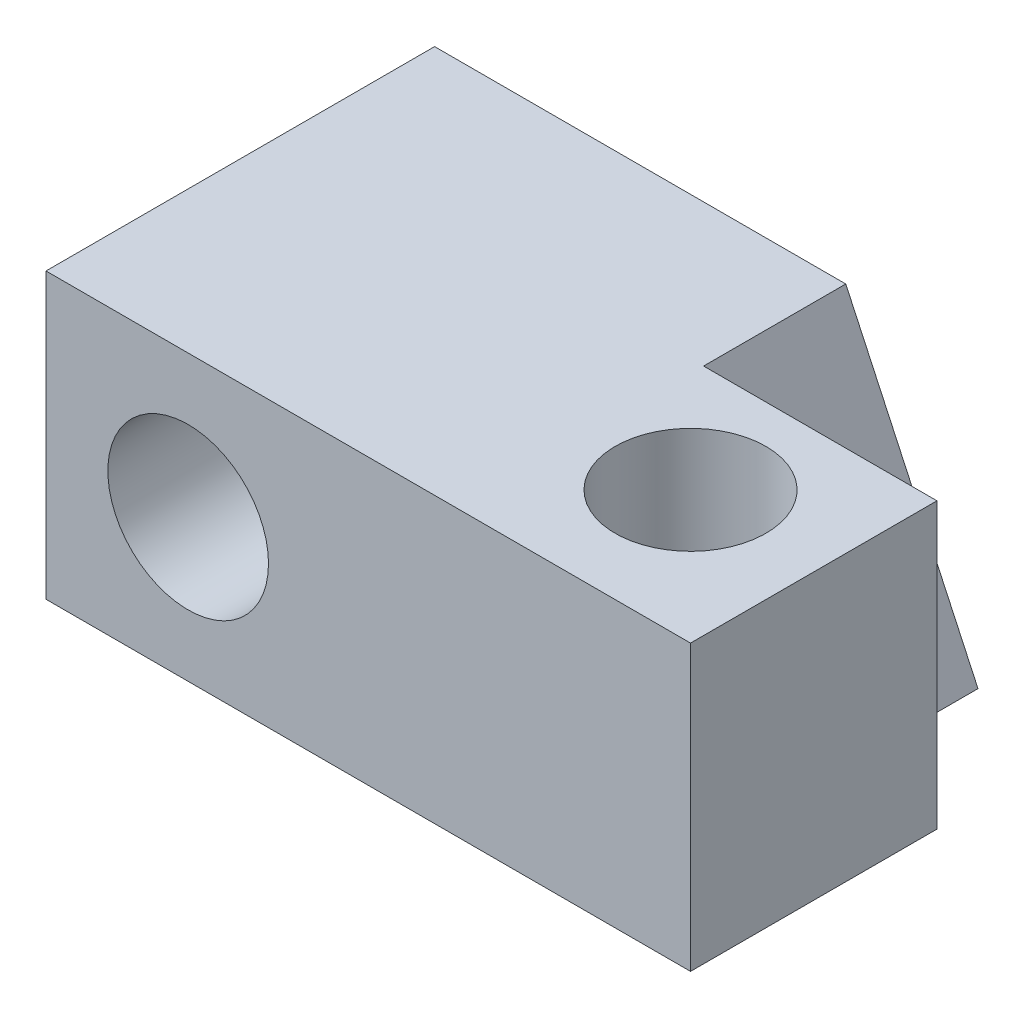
from build123d import *

# Parameters (mm, degrees)
SKETCH1_W                           = 17.272
SKETCH1_H                           = 7.62
EXTRUDE1_DEPTH                      = 10.414
F_10_32_TAPPED_HOLE1_D              = 4.0386
F_18_0_169500_DIAMETER_HOLE1_D      = 4.3053
F_1_8_0_125000_DIAMETER_HOLE1_D     = 3.175
F_1_8_0_125000_DIAMETER_HOLE1_DEPTH = 5.08
F_1_8_0_125000_DIAMETER_HOLE1_TIP   = 0.953866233
CUT_EXTRUDE1_DEPTH                  = 3.81


with BuildPart() as part:
    # Sketch1 → Extrude1 (new body)
    with BuildSketch(Plane.XY):
        with Locations((8.636, 3.81)):
            Rectangle(SKETCH1_W, SKETCH1_H)
    extrude(amount=EXTRUDE1_DEPTH)

    # 10-32 Tapped Hole1 (through all)
    with Locations(Plane.XZ):
        with Locations((13.716, 6.858)):
            Hole(F_10_32_TAPPED_HOLE1_D / 2)

    # 18 _0.169500_ Diameter Hole1 (through all)
    with Locations(Plane.XY.offset(10.414)):
        with Locations((3.81, 3.81)):
            Hole(F_18_0_169500_DIAMETER_HOLE1_D / 2)

    # 1_8 _0.125000_ Diameter Hole1
    with Locations(Plane(origin=(0, 0, 0), x_dir=(-1, 0, 0), z_dir=(0, 0, -1))):
        with Locations((-9.779, 2.54)):
            Hole(F_1_8_0_125000_DIAMETER_HOLE1_D / 2, depth=F_1_8_0_125000_DIAMETER_HOLE1_DEPTH)
            with Locations((0, 0, -(F_1_8_0_125000_DIAMETER_HOLE1_DEPTH + F_1_8_0_125000_DIAMETER_HOLE1_TIP / 2))):  # 118° drill point
                Cone(0, F_1_8_0_125000_DIAMETER_HOLE1_D / 2, F_1_8_0_125000_DIAMETER_HOLE1_TIP, mode=Mode.SUBTRACT)

    # Sketch9 → Cut-Extrude1 (cut)
    with BuildSketch(Plane(origin=(0, 0, 0), x_dir=(-1, 0, 0), z_dir=(0, 0, -1))):
        Polygon((-11.018225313, 7.62), (-14.561688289, 0), (-17.272, 0), (-17.272, 7.62), align=None)
    extrude(amount=-CUT_EXTRUDE1_DEPTH, mode=Mode.SUBTRACT)


solid = part.part
